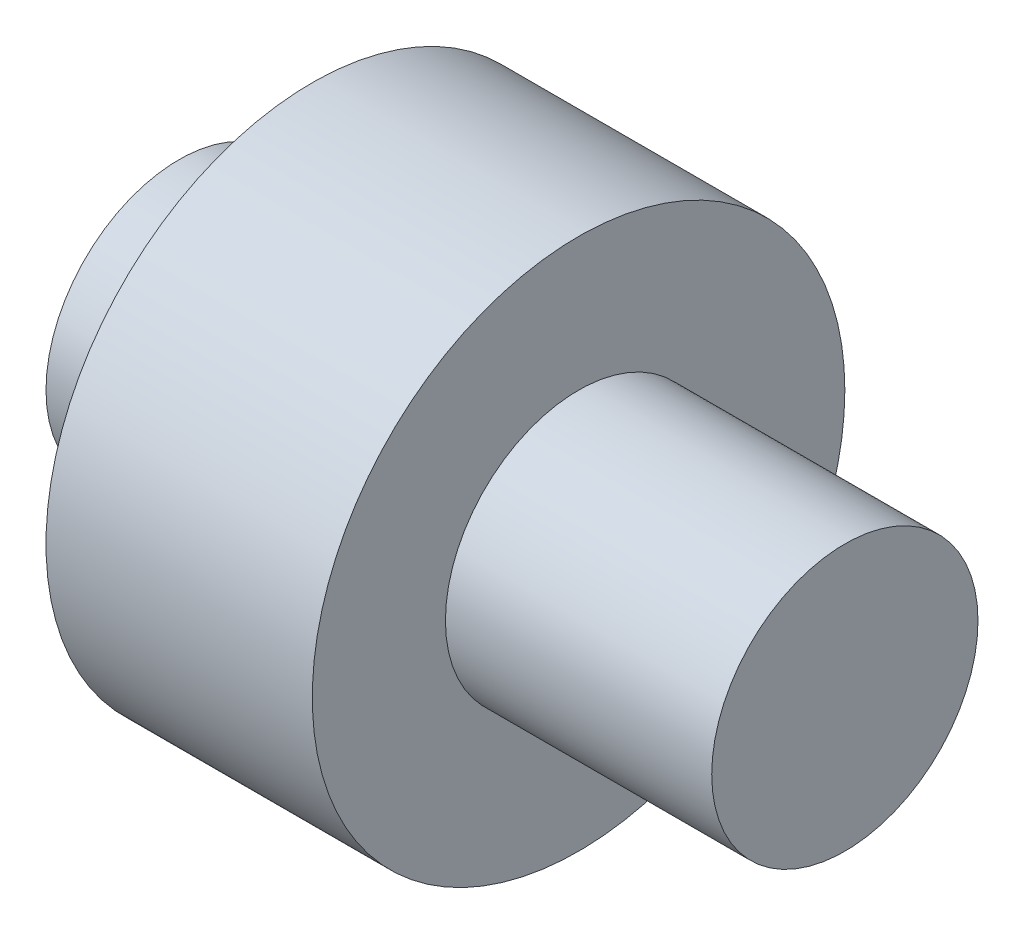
from build123d import *

# Parameters (mm, degrees)
SKETCH1_R           = 10
BOSS_EXTRUDE1_DEPTH = 10
SKETCH2_R           = 5
BOSS_EXTRUDE2_DEPTH = 5
BOSS_EXTRUDE3_START = 10
SKETCH3_R           = 5
BOSS_EXTRUDE3_DEPTH = 10


with BuildPart() as part:
    # Sketch1 → Boss-Extrude1 (new body)
    with BuildSketch(Plane(origin=(0, 0, 0), x_dir=(0, 0, -1), z_dir=(1, 0, 0))):
        Circle(SKETCH1_R)
    extrude(amount=BOSS_EXTRUDE1_DEPTH)

    # Sketch2 → Boss-Extrude2 (add)
    with BuildSketch(Plane.ZY):
        with Locations(Location((0, 0, 0), (0, 0, 180))):
            Circle(SKETCH2_R)
    extrude(amount=BOSS_EXTRUDE2_DEPTH)

    # Sketch3 → Boss-Extrude3 (add)
    with BuildSketch(Plane(origin=(10, 0, 0), x_dir=(0, 0, -1), z_dir=(1, 0, 0)).offset(BOSS_EXTRUDE3_START)):
        Circle(SKETCH3_R)
    extrude(amount=-BOSS_EXTRUDE3_DEPTH)


solid = part.part
